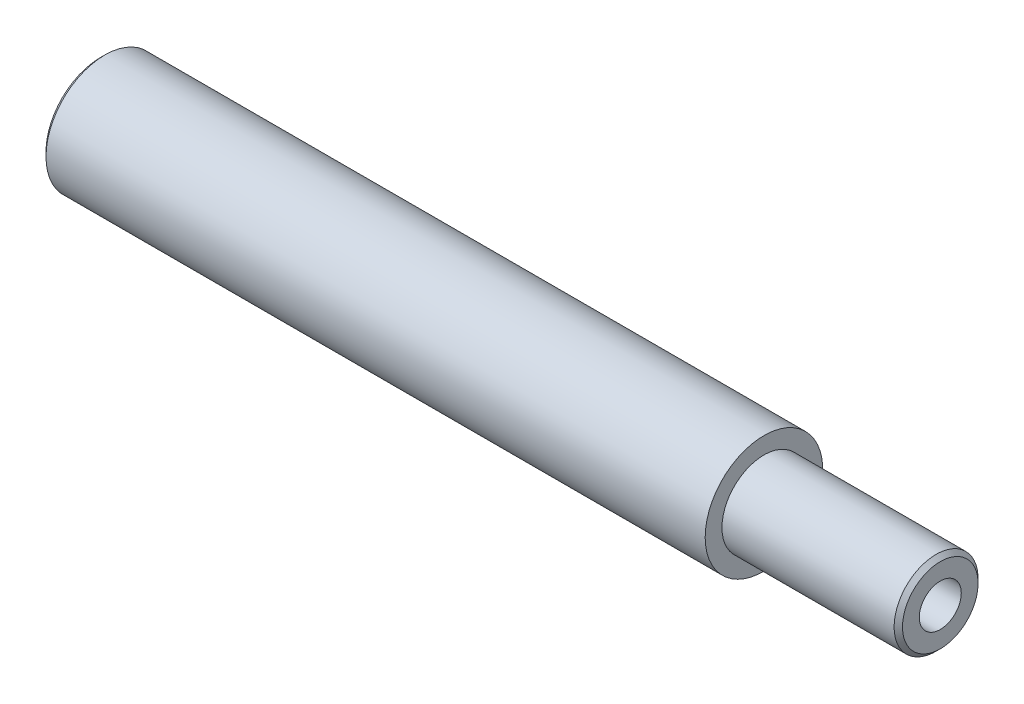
ISO-10303-21;
HEADER;
FILE_DESCRIPTION(('STEP AP214'),'2;1');
FILE_NAME('part.step','',(''),(''),'','','');
FILE_SCHEMA(('AUTOMOTIVE_DESIGN { 1 0 10303 214 1 1 1 1 }'));
ENDSEC;
DATA;
#1=APPLICATION_CONTEXT('core data for automotive mechanical design processes');
#2=APPLICATION_PROTOCOL_DEFINITION('international standard','automotive_design',2000,#1);
#3=PRODUCT_CONTEXT('',#1,'mechanical');
#4=PRODUCT('Part','Part','',(#3));
#5=PRODUCT_RELATED_PRODUCT_CATEGORY('part','',(#4));
#6=PRODUCT_DEFINITION_FORMATION('','',#4);
#7=PRODUCT_DEFINITION_CONTEXT('part definition',#1,'design');
#8=PRODUCT_DEFINITION('design','',#6,#7);
#9=PRODUCT_DEFINITION_SHAPE('','',#8);
#10=(LENGTH_UNIT() NAMED_UNIT(*) SI_UNIT(.MILLI.,.METRE.));
#11=(NAMED_UNIT(*) PLANE_ANGLE_UNIT() SI_UNIT($,.RADIAN.));
#12=(NAMED_UNIT(*) SI_UNIT($,.STERADIAN.) SOLID_ANGLE_UNIT());
#13=UNCERTAINTY_MEASURE_WITH_UNIT(LENGTH_MEASURE(1.E-05),#10,'distance_accuracy_value','');
#14=(GEOMETRIC_REPRESENTATION_CONTEXT(3) GLOBAL_UNCERTAINTY_ASSIGNED_CONTEXT((#13)) GLOBAL_UNIT_ASSIGNED_CONTEXT((#10,
#11,#12)) REPRESENTATION_CONTEXT('',''));
#15=CARTESIAN_POINT('',(0.,0.,0.));
#16=DIRECTION('',(0.,0.,1.));
#17=DIRECTION('',(1.,0.,0.));
#18=AXIS2_PLACEMENT_3D('',#15,#16,#17);
#19=CARTESIAN_POINT('',(0.,0.,0.));
#20=DIRECTION('',(1.,0.,0.));
#21=DIRECTION('',(0.,0.,-1.));
#22=AXIS2_PLACEMENT_3D('',#19,#20,#21);
#23=PLANE('',#22);
#24=CARTESIAN_POINT('',(0.,0.,0.));
#25=DIRECTION('',(-1.,0.,0.));
#26=DIRECTION('',(0.,0.,1.));
#27=AXIS2_PLACEMENT_3D('',#24,#25,#26);
#28=CIRCLE('',#27,2.49999999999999);
#29=CARTESIAN_POINT('',(0.,0.,2.49999999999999));
#30=VERTEX_POINT('',#29);
#31=EDGE_CURVE('E60',#30,#30,#28,.T.);
#32=ORIENTED_EDGE('',*,*,#31,.F.);
#33=EDGE_LOOP('',(#32));
#34=FACE_BOUND('',#33,.T.);
#35=CARTESIAN_POINT('',(0.,0.,0.));
#36=DIRECTION('',(1.,0.,0.));
#37=DIRECTION('',(0.,0.,-1.));
#38=AXIS2_PLACEMENT_3D('',#35,#36,#37);
#39=CIRCLE('',#38,6.49999999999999);
#40=CARTESIAN_POINT('',(0.,0.,-6.49999999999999));
#41=VERTEX_POINT('',#40);
#42=EDGE_CURVE('E44',#41,#41,#39,.F.);
#43=ORIENTED_EDGE('',*,*,#42,.T.);
#44=EDGE_LOOP('',(#43));
#45=FACE_BOUND('',#44,.T.);
#46=ADVANCED_FACE('F36',(#34,#45),#23,.F.);
#47=CARTESIAN_POINT('',(0.,0.,0.));
#48=DIRECTION('',(-1.,0.,0.));
#49=DIRECTION('',(0.,0.,1.));
#50=AXIS2_PLACEMENT_3D('',#47,#48,#49);
#51=CYLINDRICAL_SURFACE('',#50,7.);
#52=CARTESIAN_POINT('',(0.500000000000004,0.,0.));
#53=DIRECTION('',(1.,0.,0.));
#54=DIRECTION('',(0.,0.,-1.));
#55=AXIS2_PLACEMENT_3D('',#52,#53,#54);
#56=CIRCLE('',#55,7.);
#57=CARTESIAN_POINT('',(0.500000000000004,0.,-7.));
#58=VERTEX_POINT('',#57);
#59=EDGE_CURVE('E11',#58,#58,#56,.T.);
#60=ORIENTED_EDGE('',*,*,#59,.T.);
#61=EDGE_LOOP('',(#60));
#62=FACE_BOUND('',#61,.T.);
#63=CARTESIAN_POINT('',(79.,0.,0.));
#64=DIRECTION('',(-1.,0.,0.));
#65=DIRECTION('',(0.,0.,1.));
#66=AXIS2_PLACEMENT_3D('',#63,#64,#65);
#67=CIRCLE('',#66,7.);
#68=CARTESIAN_POINT('',(79.,0.,7.));
#69=VERTEX_POINT('',#68);
#70=EDGE_CURVE('E73',#69,#69,#67,.T.);
#71=ORIENTED_EDGE('',*,*,#70,.T.);
#72=EDGE_LOOP('',(#71));
#73=FACE_BOUND('',#72,.T.);
#74=ADVANCED_FACE('F95',(#62,#73),#51,.T.);
#75=CARTESIAN_POINT('',(79.,7.,0.));
#76=DIRECTION('',(-1.,0.,0.));
#77=DIRECTION('',(0.,0.,1.));
#78=AXIS2_PLACEMENT_3D('',#75,#76,#77);
#79=PLANE('',#78);
#80=ORIENTED_EDGE('',*,*,#70,.F.);
#81=EDGE_LOOP('',(#80));
#82=FACE_BOUND('',#81,.T.);
#83=CARTESIAN_POINT('',(79.,0.,0.));
#84=DIRECTION('',(-1.,0.,0.));
#85=DIRECTION('',(0.,0.,1.));
#86=AXIS2_PLACEMENT_3D('',#83,#84,#85);
#87=CIRCLE('',#86,5.);
#88=CARTESIAN_POINT('',(79.,0.,5.));
#89=VERTEX_POINT('',#88);
#90=EDGE_CURVE('E70',#89,#89,#87,.T.);
#91=ORIENTED_EDGE('',*,*,#90,.T.);
#92=EDGE_LOOP('',(#91));
#93=FACE_BOUND('',#92,.T.);
#94=ADVANCED_FACE('F101',(#82,#93),#79,.F.);
#95=CARTESIAN_POINT('',(0.,0.,0.));
#96=DIRECTION('',(-1.,0.,0.));
#97=DIRECTION('',(0.,0.,1.));
#98=AXIS2_PLACEMENT_3D('',#95,#96,#97);
#99=CYLINDRICAL_SURFACE('',#98,5.);
#100=CARTESIAN_POINT('',(99.5,0.,0.));
#101=DIRECTION('',(-1.,0.,0.));
#102=DIRECTION('',(0.,0.,1.));
#103=AXIS2_PLACEMENT_3D('',#100,#101,#102);
#104=CIRCLE('',#103,5.);
#105=CARTESIAN_POINT('',(99.5,0.,5.));
#106=VERTEX_POINT('',#105);
#107=EDGE_CURVE('E76',#106,#106,#104,.T.);
#108=ORIENTED_EDGE('',*,*,#107,.T.);
#109=EDGE_LOOP('',(#108));
#110=FACE_BOUND('',#109,.T.);
#111=ORIENTED_EDGE('',*,*,#90,.F.);
#112=EDGE_LOOP('',(#111));
#113=FACE_BOUND('',#112,.T.);
#114=ADVANCED_FACE('F108',(#110,#113),#99,.T.);
#115=CARTESIAN_POINT('',(100.,5.,0.));
#116=DIRECTION('',(-1.,0.,0.));
#117=DIRECTION('',(0.,0.,1.));
#118=AXIS2_PLACEMENT_3D('',#115,#116,#117);
#119=PLANE('',#118);
#120=CARTESIAN_POINT('',(100.,0.,0.));
#121=DIRECTION('',(-1.,0.,0.));
#122=DIRECTION('',(0.,0.,1.));
#123=AXIS2_PLACEMENT_3D('',#120,#121,#122);
#124=CIRCLE('',#123,4.5);
#125=CARTESIAN_POINT('',(100.,0.,4.5));
#126=VERTEX_POINT('',#125);
#127=EDGE_CURVE('E79',#126,#126,#124,.F.);
#128=ORIENTED_EDGE('',*,*,#127,.T.);
#129=EDGE_LOOP('',(#128));
#130=FACE_BOUND('',#129,.T.);
#131=CARTESIAN_POINT('',(100.,0.,0.));
#132=DIRECTION('',(1.,0.,0.));
#133=DIRECTION('',(0.,0.,-1.));
#134=AXIS2_PLACEMENT_3D('',#131,#132,#133);
#135=CIRCLE('',#134,2.5);
#136=CARTESIAN_POINT('',(100.,0.,-2.5));
#137=VERTEX_POINT('',#136);
#138=EDGE_CURVE('E59',#137,#137,#135,.T.);
#139=ORIENTED_EDGE('',*,*,#138,.F.);
#140=EDGE_LOOP('',(#139));
#141=FACE_BOUND('',#140,.T.);
#142=ADVANCED_FACE('F112',(#130,#141),#119,.F.);
#143=CARTESIAN_POINT('',(80.,0.,0.));
#144=DIRECTION('',(1.,0.,0.));
#145=DIRECTION('',(0.,0.,-1.));
#146=AXIS2_PLACEMENT_3D('',#143,#144,#145);
#147=CONICAL_SURFACE('',#146,2.49999999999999,1.02974425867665);
#148=CARTESIAN_POINT('',(78.4978484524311,0.,0.));
#149=VERTEX_POINT('',#148);
#150=VERTEX_LOOP('',#149);
#151=FACE_BOUND('',#150,.T.);
#152=CARTESIAN_POINT('',(80.,0.,0.));
#153=DIRECTION('',(1.,0.,0.));
#154=DIRECTION('',(0.,0.,-1.));
#155=AXIS2_PLACEMENT_3D('',#152,#153,#154);
#156=CIRCLE('',#155,2.49999999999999);
#157=CARTESIAN_POINT('',(80.,0.,-2.49999999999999));
#158=VERTEX_POINT('',#157);
#159=EDGE_CURVE('E63',#158,#158,#156,.T.);
#160=ORIENTED_EDGE('',*,*,#159,.T.);
#161=EDGE_LOOP('',(#160));
#162=FACE_BOUND('',#161,.T.);
#163=ADVANCED_FACE('F116',(#151,#162),#147,.F.);
#164=CARTESIAN_POINT('',(100.,0.,0.));
#165=DIRECTION('',(1.,0.,0.));
#166=DIRECTION('',(0.,0.,-1.));
#167=AXIS2_PLACEMENT_3D('',#164,#165,#166);
#168=CYLINDRICAL_SURFACE('',#167,2.5);
#169=ORIENTED_EDGE('',*,*,#159,.F.);
#170=EDGE_LOOP('',(#169));
#171=FACE_BOUND('',#170,.T.);
#172=ORIENTED_EDGE('',*,*,#138,.T.);
#173=EDGE_LOOP('',(#172));
#174=FACE_BOUND('',#173,.T.);
#175=ADVANCED_FACE('F91',(#171,#174),#168,.F.);
#176=CARTESIAN_POINT('',(99.5,0.,0.));
#177=DIRECTION('',(-1.,0.,0.));
#178=DIRECTION('',(0.,0.,1.));
#179=AXIS2_PLACEMENT_3D('',#176,#177,#178);
#180=CONICAL_SURFACE('',#179,5.,0.785398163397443);
#181=ORIENTED_EDGE('',*,*,#127,.F.);
#182=EDGE_LOOP('',(#181));
#183=FACE_BOUND('',#182,.T.);
#184=ORIENTED_EDGE('',*,*,#107,.F.);
#185=EDGE_LOOP('',(#184));
#186=FACE_BOUND('',#185,.T.);
#187=ADVANCED_FACE('F86',(#183,#186),#180,.T.);
#188=CARTESIAN_POINT('',(0.,0.,0.));
#189=DIRECTION('',(1.,0.,0.));
#190=DIRECTION('',(0.,0.,-1.));
#191=AXIS2_PLACEMENT_3D('',#188,#189,#190);
#192=CONICAL_SURFACE('',#191,6.49999999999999,0.785398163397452);
#193=ORIENTED_EDGE('',*,*,#59,.F.);
#194=EDGE_LOOP('',(#193));
#195=FACE_BOUND('',#194,.T.);
#196=ORIENTED_EDGE('',*,*,#42,.F.);
#197=EDGE_LOOP('',(#196));
#198=FACE_BOUND('',#197,.T.);
#199=ADVANCED_FACE('F38',(#195,#198),#192,.T.);
#200=CARTESIAN_POINT('',(20.,0.,0.));
#201=DIRECTION('',(-1.,0.,0.));
#202=DIRECTION('',(0.,0.,1.));
#203=AXIS2_PLACEMENT_3D('',#200,#201,#202);
#204=CONICAL_SURFACE('',#203,2.49999999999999,1.02974425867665);
#205=CARTESIAN_POINT('',(21.5021515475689,0.,0.));
#206=VERTEX_POINT('',#205);
#207=VERTEX_LOOP('',#206);
#208=FACE_BOUND('',#207,.T.);
#209=CARTESIAN_POINT('',(20.,0.,0.));
#210=DIRECTION('',(-1.,0.,0.));
#211=DIRECTION('',(0.,0.,1.));
#212=AXIS2_PLACEMENT_3D('',#209,#210,#211);
#213=CIRCLE('',#212,2.49999999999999);
#214=CARTESIAN_POINT('',(20.,0.,2.49999999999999));
#215=VERTEX_POINT('',#214);
#216=EDGE_CURVE('E57',#215,#215,#213,.T.);
#217=ORIENTED_EDGE('',*,*,#216,.T.);
#218=EDGE_LOOP('',(#217));
#219=FACE_BOUND('',#218,.T.);
#220=ADVANCED_FACE('F50',(#208,#219),#204,.F.);
#221=CARTESIAN_POINT('',(0.,0.,0.));
#222=DIRECTION('',(-1.,0.,0.));
#223=DIRECTION('',(0.,0.,1.));
#224=AXIS2_PLACEMENT_3D('',#221,#222,#223);
#225=CYLINDRICAL_SURFACE('',#224,2.49999999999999);
#226=ORIENTED_EDGE('',*,*,#216,.F.);
#227=EDGE_LOOP('',(#226));
#228=FACE_BOUND('',#227,.T.);
#229=ORIENTED_EDGE('',*,*,#31,.T.);
#230=EDGE_LOOP('',(#229));
#231=FACE_BOUND('',#230,.T.);
#232=ADVANCED_FACE('F53',(#228,#231),#225,.F.);
#233=CLOSED_SHELL('',(#46,#74,#94,#114,#142,#163,#175,#187,#199,#220,#232));
#234=MANIFOLD_SOLID_BREP('B2',#233);
#235=ADVANCED_BREP_SHAPE_REPRESENTATION('',(#18,#234),#14);
#236=SHAPE_DEFINITION_REPRESENTATION(#9,#235);
ENDSEC;
END-ISO-10303-21;
